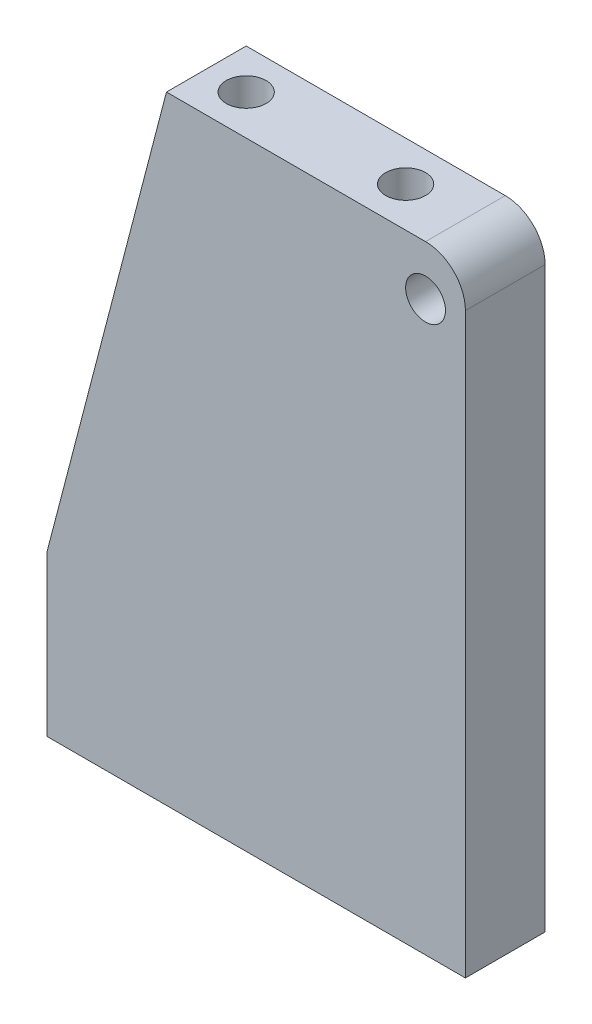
ISO-10303-21;
HEADER;
FILE_DESCRIPTION(('STEP AP214'),'2;1');
FILE_NAME('part.step','',(''),(''),'','','');
FILE_SCHEMA(('AUTOMOTIVE_DESIGN { 1 0 10303 214 1 1 1 1 }'));
ENDSEC;
DATA;
#1=APPLICATION_CONTEXT('core data for automotive mechanical design processes');
#2=APPLICATION_PROTOCOL_DEFINITION('international standard','automotive_design',2000,#1);
#3=PRODUCT_CONTEXT('',#1,'mechanical');
#4=PRODUCT('Part','Part','',(#3));
#5=PRODUCT_RELATED_PRODUCT_CATEGORY('part','',(#4));
#6=PRODUCT_DEFINITION_FORMATION('','',#4);
#7=PRODUCT_DEFINITION_CONTEXT('part definition',#1,'design');
#8=PRODUCT_DEFINITION('design','',#6,#7);
#9=PRODUCT_DEFINITION_SHAPE('','',#8);
#10=(LENGTH_UNIT() NAMED_UNIT(*) SI_UNIT(.MILLI.,.METRE.));
#11=(NAMED_UNIT(*) PLANE_ANGLE_UNIT() SI_UNIT($,.RADIAN.));
#12=(NAMED_UNIT(*) SI_UNIT($,.STERADIAN.) SOLID_ANGLE_UNIT());
#13=UNCERTAINTY_MEASURE_WITH_UNIT(LENGTH_MEASURE(1.E-05),#10,'distance_accuracy_value','');
#14=(GEOMETRIC_REPRESENTATION_CONTEXT(3) GLOBAL_UNCERTAINTY_ASSIGNED_CONTEXT((#13)) GLOBAL_UNIT_ASSIGNED_CONTEXT((#10,
#11,#12)) REPRESENTATION_CONTEXT('',''));
#15=CARTESIAN_POINT('',(0.,0.,0.));
#16=DIRECTION('',(0.,0.,1.));
#17=DIRECTION('',(1.,0.,0.));
#18=AXIS2_PLACEMENT_3D('',#15,#16,#17);
#19=CARTESIAN_POINT('',(0.,0.,6.35));
#20=DIRECTION('',(0.,0.,1.));
#21=DIRECTION('',(1.,0.,0.));
#22=AXIS2_PLACEMENT_3D('',#19,#20,#21);
#23=PLANE('',#22);
#24=DIRECTION('',(0.,1.,0.));
#25=VECTOR('',#24,1.);
#26=CARTESIAN_POINT('',(33.3375,0.,6.35));
#27=LINE('',#26,#25);
#28=CARTESIAN_POINT('',(33.3375,0.,6.35));
#29=VERTEX_POINT('',#28);
#30=CARTESIAN_POINT('',(33.3375,92.075,6.35));
#31=VERTEX_POINT('',#30);
#32=EDGE_CURVE('E138',#29,#31,#27,.T.);
#33=ORIENTED_EDGE('',*,*,#32,.T.);
#34=CARTESIAN_POINT('',(26.9875,92.075,6.35));
#35=DIRECTION('',(0.,0.,1.));
#36=DIRECTION('',(1.,0.,0.));
#37=AXIS2_PLACEMENT_3D('',#34,#35,#36);
#38=CIRCLE('',#37,6.35);
#39=CARTESIAN_POINT('',(26.9875,98.425,6.35));
#40=VERTEX_POINT('',#39);
#41=EDGE_CURVE('E11',#31,#40,#38,.T.);
#42=ORIENTED_EDGE('',*,*,#41,.T.);
#43=DIRECTION('',(-1.,0.,0.));
#44=VECTOR('',#43,1.);
#45=CARTESIAN_POINT('',(33.3375,98.425,6.35));
#46=LINE('',#45,#44);
#47=CARTESIAN_POINT('',(-14.2875,98.425,6.35));
#48=VERTEX_POINT('',#47);
#49=EDGE_CURVE('E141',#40,#48,#46,.T.);
#50=ORIENTED_EDGE('',*,*,#49,.T.);
#51=DIRECTION('',(-0.252421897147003,-0.967617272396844,0.));
#52=VECTOR('',#51,1.);
#53=CARTESIAN_POINT('',(-14.2875,98.425,6.35));
#54=LINE('',#53,#52);
#55=CARTESIAN_POINT('',(-33.3375,25.4,6.35));
#56=VERTEX_POINT('',#55);
#57=EDGE_CURVE('E143',#48,#56,#54,.T.);
#58=ORIENTED_EDGE('',*,*,#57,.T.);
#59=DIRECTION('',(0.,-1.,0.));
#60=VECTOR('',#59,1.);
#61=CARTESIAN_POINT('',(-33.3375,25.4,6.35));
#62=LINE('',#61,#60);
#63=CARTESIAN_POINT('',(-33.3375,0.,6.35));
#64=VERTEX_POINT('',#63);
#65=EDGE_CURVE('E145',#56,#64,#62,.T.);
#66=ORIENTED_EDGE('',*,*,#65,.T.);
#67=DIRECTION('',(1.,0.,0.));
#68=VECTOR('',#67,1.);
#69=CARTESIAN_POINT('',(-33.3375,0.,6.35));
#70=LINE('',#69,#68);
#71=EDGE_CURVE('E136',#64,#29,#70,.T.);
#72=ORIENTED_EDGE('',*,*,#71,.T.);
#73=EDGE_LOOP('',(#33,#42,#50,#58,#66,#72));
#74=FACE_BOUND('',#73,.T.);
#75=CARTESIAN_POINT('',(26.9875,90.5002,6.35));
#76=DIRECTION('',(0.,0.,1.));
#77=DIRECTION('',(1.,0.,0.));
#78=AXIS2_PLACEMENT_3D('',#75,#76,#77);
#79=CIRCLE('',#78,3.175);
#80=CARTESIAN_POINT('',(30.1625,90.5002,6.35));
#81=VERTEX_POINT('',#80);
#82=EDGE_CURVE('E130',#81,#81,#79,.T.);
#83=ORIENTED_EDGE('',*,*,#82,.F.);
#84=EDGE_LOOP('',(#83));
#85=FACE_BOUND('',#84,.T.);
#86=ADVANCED_FACE('F33',(#74,#85),#23,.T.);
#87=CARTESIAN_POINT('',(0.,0.,-6.35));
#88=DIRECTION('',(0.,0.,1.));
#89=DIRECTION('',(1.,0.,0.));
#90=AXIS2_PLACEMENT_3D('',#87,#88,#89);
#91=PLANE('',#90);
#92=DIRECTION('',(-1.,0.,0.));
#93=VECTOR('',#92,1.);
#94=CARTESIAN_POINT('',(33.3375,98.425,-6.35));
#95=LINE('',#94,#93);
#96=CARTESIAN_POINT('',(26.9875,98.425,-6.35));
#97=VERTEX_POINT('',#96);
#98=CARTESIAN_POINT('',(-14.2875,98.425,-6.35));
#99=VERTEX_POINT('',#98);
#100=EDGE_CURVE('E151',#97,#99,#95,.T.);
#101=ORIENTED_EDGE('',*,*,#100,.F.);
#102=CARTESIAN_POINT('',(26.9875,92.075,-6.35));
#103=DIRECTION('',(0.,0.,1.));
#104=DIRECTION('',(1.,0.,0.));
#105=AXIS2_PLACEMENT_3D('',#102,#103,#104);
#106=CIRCLE('',#105,6.35);
#107=CARTESIAN_POINT('',(33.3375,92.075,-6.35));
#108=VERTEX_POINT('',#107);
#109=EDGE_CURVE('E55',#97,#108,#106,.F.);
#110=ORIENTED_EDGE('',*,*,#109,.T.);
#111=DIRECTION('',(0.,1.,0.));
#112=VECTOR('',#111,1.);
#113=CARTESIAN_POINT('',(33.3375,0.,-6.35));
#114=LINE('',#113,#112);
#115=CARTESIAN_POINT('',(33.3375,0.,-6.35));
#116=VERTEX_POINT('',#115);
#117=EDGE_CURVE('E149',#116,#108,#114,.T.);
#118=ORIENTED_EDGE('',*,*,#117,.F.);
#119=DIRECTION('',(1.,0.,0.));
#120=VECTOR('',#119,1.);
#121=CARTESIAN_POINT('',(0.,0.,-6.35));
#122=LINE('',#121,#120);
#123=CARTESIAN_POINT('',(-33.3375,0.,-6.35));
#124=VERTEX_POINT('',#123);
#125=EDGE_CURVE('E133',#124,#116,#122,.T.);
#126=ORIENTED_EDGE('',*,*,#125,.F.);
#127=DIRECTION('',(0.,-1.,0.));
#128=VECTOR('',#127,1.);
#129=CARTESIAN_POINT('',(-33.3375,25.4,-6.35));
#130=LINE('',#129,#128);
#131=CARTESIAN_POINT('',(-33.3375,25.4,-6.35));
#132=VERTEX_POINT('',#131);
#133=EDGE_CURVE('E139',#132,#124,#130,.T.);
#134=ORIENTED_EDGE('',*,*,#133,.F.);
#135=DIRECTION('',(-0.252421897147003,-0.967617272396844,0.));
#136=VECTOR('',#135,1.);
#137=CARTESIAN_POINT('',(-14.2875,98.425,-6.35));
#138=LINE('',#137,#136);
#139=EDGE_CURVE('E153',#99,#132,#138,.T.);
#140=ORIENTED_EDGE('',*,*,#139,.F.);
#141=EDGE_LOOP('',(#101,#110,#118,#126,#134,#140));
#142=FACE_BOUND('',#141,.T.);
#143=CARTESIAN_POINT('',(26.9875,90.5002,-6.35));
#144=DIRECTION('',(0.,0.,1.));
#145=DIRECTION('',(1.,0.,0.));
#146=AXIS2_PLACEMENT_3D('',#143,#144,#145);
#147=CIRCLE('',#146,3.175);
#148=CARTESIAN_POINT('',(30.1625,90.5002,-6.35));
#149=VERTEX_POINT('',#148);
#150=EDGE_CURVE('E129',#149,#149,#147,.T.);
#151=ORIENTED_EDGE('',*,*,#150,.T.);
#152=EDGE_LOOP('',(#151));
#153=FACE_BOUND('',#152,.T.);
#154=ADVANCED_FACE('F179',(#142,#153),#91,.F.);
#155=CARTESIAN_POINT('',(0.,0.,6.35));
#156=DIRECTION('',(0.,1.,0.));
#157=DIRECTION('',(0.,0.,1.));
#158=AXIS2_PLACEMENT_3D('',#155,#156,#157);
#159=PLANE('',#158);
#160=CARTESIAN_POINT('',(-25.4,0.,0.));
#161=DIRECTION('',(0.,-1.,0.));
#162=DIRECTION('',(0.,0.,-1.));
#163=AXIS2_PLACEMENT_3D('',#160,#161,#162);
#164=CIRCLE('',#163,3.96875);
#165=CARTESIAN_POINT('',(-25.4,0.,-3.96875));
#166=VERTEX_POINT('',#165);
#167=EDGE_CURVE('E117',#166,#166,#164,.T.);
#168=ORIENTED_EDGE('',*,*,#167,.F.);
#169=EDGE_LOOP('',(#168));
#170=FACE_BOUND('',#169,.T.);
#171=CARTESIAN_POINT('',(25.4,0.,0.));
#172=DIRECTION('',(0.,-1.,0.));
#173=DIRECTION('',(0.,0.,-1.));
#174=AXIS2_PLACEMENT_3D('',#171,#172,#173);
#175=CIRCLE('',#174,3.96875);
#176=CARTESIAN_POINT('',(25.4,0.,-3.96875));
#177=VERTEX_POINT('',#176);
#178=EDGE_CURVE('E123',#177,#177,#175,.T.);
#179=ORIENTED_EDGE('',*,*,#178,.F.);
#180=EDGE_LOOP('',(#179));
#181=FACE_BOUND('',#180,.T.);
#182=ORIENTED_EDGE('',*,*,#125,.T.);
#183=DIRECTION('',(0.,0.,-1.));
#184=VECTOR('',#183,1.);
#185=CARTESIAN_POINT('',(33.3375,0.,6.35));
#186=LINE('',#185,#184);
#187=EDGE_CURVE('E165',#29,#116,#186,.T.);
#188=ORIENTED_EDGE('',*,*,#187,.F.);
#189=ORIENTED_EDGE('',*,*,#71,.F.);
#190=DIRECTION('',(0.,0.,-1.));
#191=VECTOR('',#190,1.);
#192=CARTESIAN_POINT('',(-33.3375,0.,6.35));
#193=LINE('',#192,#191);
#194=EDGE_CURVE('E147',#64,#124,#193,.T.);
#195=ORIENTED_EDGE('',*,*,#194,.T.);
#196=EDGE_LOOP('',(#182,#188,#189,#195));
#197=FACE_BOUND('',#196,.T.);
#198=ADVANCED_FACE('F204',(#170,#181,#197),#159,.F.);
#199=CARTESIAN_POINT('',(33.3375,0.,6.35));
#200=DIRECTION('',(-1.,0.,0.));
#201=DIRECTION('',(0.,0.,1.));
#202=AXIS2_PLACEMENT_3D('',#199,#200,#201);
#203=PLANE('',#202);
#204=ORIENTED_EDGE('',*,*,#117,.T.);
#205=DIRECTION('',(0.,0.,-1.));
#206=VECTOR('',#205,1.);
#207=CARTESIAN_POINT('',(33.3375,92.075,6.35));
#208=LINE('',#207,#206);
#209=EDGE_CURVE('E41',#108,#31,#208,.F.);
#210=ORIENTED_EDGE('',*,*,#209,.T.);
#211=ORIENTED_EDGE('',*,*,#32,.F.);
#212=ORIENTED_EDGE('',*,*,#187,.T.);
#213=EDGE_LOOP('',(#204,#210,#211,#212));
#214=FACE_BOUND('',#213,.T.);
#215=ADVANCED_FACE('F216',(#214),#203,.F.);
#216=CARTESIAN_POINT('',(33.3375,98.425,6.35));
#217=DIRECTION('',(0.,-1.,0.));
#218=DIRECTION('',(1.,0.,0.));
#219=AXIS2_PLACEMENT_3D('',#216,#217,#218);
#220=PLANE('',#219);
#221=CARTESIAN_POINT('',(-7.93750000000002,98.425,0.));
#222=DIRECTION('',(0.,1.,0.));
#223=DIRECTION('',(0.,0.,1.));
#224=AXIS2_PLACEMENT_3D('',#221,#222,#223);
#225=CIRCLE('',#224,3.175);
#226=CARTESIAN_POINT('',(-7.93750000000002,98.425,3.175));
#227=VERTEX_POINT('',#226);
#228=EDGE_CURVE('E107',#227,#227,#225,.T.);
#229=ORIENTED_EDGE('',*,*,#228,.F.);
#230=EDGE_LOOP('',(#229));
#231=FACE_BOUND('',#230,.T.);
#232=CARTESIAN_POINT('',(17.4625,98.425,0.));
#233=DIRECTION('',(0.,1.,0.));
#234=DIRECTION('',(0.,0.,1.));
#235=AXIS2_PLACEMENT_3D('',#232,#233,#234);
#236=CIRCLE('',#235,3.175);
#237=CARTESIAN_POINT('',(17.4625,98.425,3.175));
#238=VERTEX_POINT('',#237);
#239=EDGE_CURVE('E106',#238,#238,#236,.T.);
#240=ORIENTED_EDGE('',*,*,#239,.F.);
#241=EDGE_LOOP('',(#240));
#242=FACE_BOUND('',#241,.T.);
#243=ORIENTED_EDGE('',*,*,#49,.F.);
#244=DIRECTION('',(0.,0.,-1.));
#245=VECTOR('',#244,1.);
#246=CARTESIAN_POINT('',(26.9875,98.425,6.35));
#247=LINE('',#246,#245);
#248=EDGE_CURVE('E168',#40,#97,#247,.T.);
#249=ORIENTED_EDGE('',*,*,#248,.T.);
#250=ORIENTED_EDGE('',*,*,#100,.T.);
#251=DIRECTION('',(0.,0.,-1.));
#252=VECTOR('',#251,1.);
#253=CARTESIAN_POINT('',(-14.2875,98.425,6.35));
#254=LINE('',#253,#252);
#255=EDGE_CURVE('E162',#48,#99,#254,.T.);
#256=ORIENTED_EDGE('',*,*,#255,.F.);
#257=EDGE_LOOP('',(#243,#249,#250,#256));
#258=FACE_BOUND('',#257,.T.);
#259=ADVANCED_FACE('F174',(#231,#242,#258),#220,.F.);
#260=CARTESIAN_POINT('',(-14.2875,98.425,6.35));
#261=DIRECTION('',(0.967617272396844,-0.252421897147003,0.));
#262=DIRECTION('',(0.252421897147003,0.967617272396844,0.));
#263=AXIS2_PLACEMENT_3D('',#260,#261,#262);
#264=PLANE('',#263);
#265=ORIENTED_EDGE('',*,*,#139,.T.);
#266=DIRECTION('',(0.,0.,-1.));
#267=VECTOR('',#266,1.);
#268=CARTESIAN_POINT('',(-33.3375,25.4,6.35));
#269=LINE('',#268,#267);
#270=EDGE_CURVE('E159',#56,#132,#269,.T.);
#271=ORIENTED_EDGE('',*,*,#270,.F.);
#272=ORIENTED_EDGE('',*,*,#57,.F.);
#273=ORIENTED_EDGE('',*,*,#255,.T.);
#274=EDGE_LOOP('',(#265,#271,#272,#273));
#275=FACE_BOUND('',#274,.T.);
#276=ADVANCED_FACE('F184',(#275),#264,.F.);
#277=CARTESIAN_POINT('',(-33.3375,25.4,6.35));
#278=DIRECTION('',(1.,0.,0.));
#279=DIRECTION('',(0.,1.,0.));
#280=AXIS2_PLACEMENT_3D('',#277,#278,#279);
#281=PLANE('',#280);
#282=ORIENTED_EDGE('',*,*,#133,.T.);
#283=ORIENTED_EDGE('',*,*,#194,.F.);
#284=ORIENTED_EDGE('',*,*,#65,.F.);
#285=ORIENTED_EDGE('',*,*,#270,.T.);
#286=EDGE_LOOP('',(#282,#283,#284,#285));
#287=FACE_BOUND('',#286,.T.);
#288=ADVANCED_FACE('F188',(#287),#281,.F.);
#289=CARTESIAN_POINT('',(26.9875,90.5002,6.35));
#290=DIRECTION('',(0.,0.,-1.));
#291=DIRECTION('',(-1.,0.,0.));
#292=AXIS2_PLACEMENT_3D('',#289,#290,#291);
#293=CYLINDRICAL_SURFACE('',#292,3.175);
#294=ORIENTED_EDGE('',*,*,#82,.T.);
#295=EDGE_LOOP('',(#294));
#296=FACE_BOUND('',#295,.T.);
#297=ORIENTED_EDGE('',*,*,#150,.F.);
#298=EDGE_LOOP('',(#297));
#299=FACE_BOUND('',#298,.T.);
#300=ADVANCED_FACE('F207',(#296,#299),#293,.F.);
#301=CARTESIAN_POINT('',(25.4,19.05,0.));
#302=DIRECTION('',(0.,-1.,0.));
#303=DIRECTION('',(0.,0.,-1.));
#304=AXIS2_PLACEMENT_3D('',#301,#302,#303);
#305=CONICAL_SURFACE('',#304,3.96875,1.02974425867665);
#306=CARTESIAN_POINT('',(25.4,21.4346655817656,0.));
#307=VERTEX_POINT('',#306);
#308=VERTEX_LOOP('',#307);
#309=FACE_BOUND('',#308,.T.);
#310=CARTESIAN_POINT('',(25.4,19.05,0.));
#311=DIRECTION('',(0.,-1.,0.));
#312=DIRECTION('',(0.,0.,-1.));
#313=AXIS2_PLACEMENT_3D('',#310,#311,#312);
#314=CIRCLE('',#313,3.96875);
#315=CARTESIAN_POINT('',(25.4,19.05,-3.96875));
#316=VERTEX_POINT('',#315);
#317=EDGE_CURVE('E126',#316,#316,#314,.T.);
#318=ORIENTED_EDGE('',*,*,#317,.T.);
#319=EDGE_LOOP('',(#318));
#320=FACE_BOUND('',#319,.T.);
#321=ADVANCED_FACE('F231',(#309,#320),#305,.F.);
#322=CARTESIAN_POINT('',(25.4,0.,0.));
#323=DIRECTION('',(0.,-1.,0.));
#324=DIRECTION('',(0.,0.,-1.));
#325=AXIS2_PLACEMENT_3D('',#322,#323,#324);
#326=CYLINDRICAL_SURFACE('',#325,3.96875);
#327=ORIENTED_EDGE('',*,*,#317,.F.);
#328=EDGE_LOOP('',(#327));
#329=FACE_BOUND('',#328,.T.);
#330=ORIENTED_EDGE('',*,*,#178,.T.);
#331=EDGE_LOOP('',(#330));
#332=FACE_BOUND('',#331,.T.);
#333=ADVANCED_FACE('F228',(#329,#332),#326,.F.);
#334=CARTESIAN_POINT('',(-25.4,19.05,0.));
#335=DIRECTION('',(0.,-1.,0.));
#336=DIRECTION('',(0.,0.,-1.));
#337=AXIS2_PLACEMENT_3D('',#334,#335,#336);
#338=CONICAL_SURFACE('',#337,3.96875,1.02974425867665);
#339=CARTESIAN_POINT('',(-25.4,21.4346655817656,0.));
#340=VERTEX_POINT('',#339);
#341=VERTEX_LOOP('',#340);
#342=FACE_BOUND('',#341,.T.);
#343=CARTESIAN_POINT('',(-25.4,19.05,0.));
#344=DIRECTION('',(0.,-1.,0.));
#345=DIRECTION('',(0.,0.,-1.));
#346=AXIS2_PLACEMENT_3D('',#343,#344,#345);
#347=CIRCLE('',#346,3.96875);
#348=CARTESIAN_POINT('',(-25.4,19.05,-3.96875));
#349=VERTEX_POINT('',#348);
#350=EDGE_CURVE('E120',#349,#349,#347,.T.);
#351=ORIENTED_EDGE('',*,*,#350,.T.);
#352=EDGE_LOOP('',(#351));
#353=FACE_BOUND('',#352,.T.);
#354=ADVANCED_FACE('F230',(#342,#353),#338,.F.);
#355=CARTESIAN_POINT('',(-25.4,0.,0.));
#356=DIRECTION('',(0.,-1.,0.));
#357=DIRECTION('',(0.,0.,-1.));
#358=AXIS2_PLACEMENT_3D('',#355,#356,#357);
#359=CYLINDRICAL_SURFACE('',#358,3.96875);
#360=ORIENTED_EDGE('',*,*,#350,.F.);
#361=EDGE_LOOP('',(#360));
#362=FACE_BOUND('',#361,.T.);
#363=ORIENTED_EDGE('',*,*,#167,.T.);
#364=EDGE_LOOP('',(#363));
#365=FACE_BOUND('',#364,.T.);
#366=ADVANCED_FACE('F238',(#362,#365),#359,.F.);
#367=CARTESIAN_POINT('',(17.4625,79.375,0.));
#368=DIRECTION('',(0.,1.,0.));
#369=DIRECTION('',(0.,0.,1.));
#370=AXIS2_PLACEMENT_3D('',#367,#368,#369);
#371=CONICAL_SURFACE('',#370,3.17499999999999,1.02974425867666);
#372=CARTESIAN_POINT('',(17.4625,77.4672675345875,0.));
#373=VERTEX_POINT('',#372);
#374=VERTEX_LOOP('',#373);
#375=FACE_BOUND('',#374,.T.);
#376=CARTESIAN_POINT('',(17.4625,79.375,0.));
#377=DIRECTION('',(0.,1.,0.));
#378=DIRECTION('',(0.,0.,1.));
#379=AXIS2_PLACEMENT_3D('',#376,#377,#378);
#380=CIRCLE('',#379,3.17499999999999);
#381=CARTESIAN_POINT('',(17.4625,79.375,3.17499999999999));
#382=VERTEX_POINT('',#381);
#383=EDGE_CURVE('E110',#382,#382,#380,.T.);
#384=ORIENTED_EDGE('',*,*,#383,.T.);
#385=EDGE_LOOP('',(#384));
#386=FACE_BOUND('',#385,.T.);
#387=ADVANCED_FACE('F246',(#375,#386),#371,.F.);
#388=CARTESIAN_POINT('',(17.4625,98.425,0.));
#389=DIRECTION('',(0.,1.,0.));
#390=DIRECTION('',(0.,0.,1.));
#391=AXIS2_PLACEMENT_3D('',#388,#389,#390);
#392=CYLINDRICAL_SURFACE('',#391,3.175);
#393=ORIENTED_EDGE('',*,*,#383,.F.);
#394=EDGE_LOOP('',(#393));
#395=FACE_BOUND('',#394,.T.);
#396=ORIENTED_EDGE('',*,*,#239,.T.);
#397=EDGE_LOOP('',(#396));
#398=FACE_BOUND('',#397,.T.);
#399=ADVANCED_FACE('F100',(#395,#398),#392,.F.);
#400=CARTESIAN_POINT('',(-7.93750000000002,79.375,0.));
#401=DIRECTION('',(0.,1.,0.));
#402=DIRECTION('',(0.,0.,1.));
#403=AXIS2_PLACEMENT_3D('',#400,#401,#402);
#404=CONICAL_SURFACE('',#403,3.175,1.02974425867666);
#405=CARTESIAN_POINT('',(-7.93750000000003,77.4672675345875,0.));
#406=VERTEX_POINT('',#405);
#407=VERTEX_LOOP('',#406);
#408=FACE_BOUND('',#407,.T.);
#409=CARTESIAN_POINT('',(-7.93750000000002,79.375,0.));
#410=DIRECTION('',(0.,1.,0.));
#411=DIRECTION('',(0.,0.,1.));
#412=AXIS2_PLACEMENT_3D('',#409,#410,#411);
#413=CIRCLE('',#412,3.175);
#414=CARTESIAN_POINT('',(-7.93750000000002,79.375,3.175));
#415=VERTEX_POINT('',#414);
#416=EDGE_CURVE('E104',#415,#415,#413,.T.);
#417=ORIENTED_EDGE('',*,*,#416,.T.);
#418=EDGE_LOOP('',(#417));
#419=FACE_BOUND('',#418,.T.);
#420=ADVANCED_FACE('F96',(#408,#419),#404,.F.);
#421=CARTESIAN_POINT('',(-7.93750000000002,98.425,0.));
#422=DIRECTION('',(0.,1.,0.));
#423=DIRECTION('',(0.,0.,1.));
#424=AXIS2_PLACEMENT_3D('',#421,#422,#423);
#425=CYLINDRICAL_SURFACE('',#424,3.175);
#426=ORIENTED_EDGE('',*,*,#416,.F.);
#427=EDGE_LOOP('',(#426));
#428=FACE_BOUND('',#427,.T.);
#429=ORIENTED_EDGE('',*,*,#228,.T.);
#430=EDGE_LOOP('',(#429));
#431=FACE_BOUND('',#430,.T.);
#432=ADVANCED_FACE('F99',(#428,#431),#425,.F.);
#433=CARTESIAN_POINT('',(26.9875,92.075,6.35));
#434=DIRECTION('',(0.,0.,-1.));
#435=DIRECTION('',(-1.,0.,0.));
#436=AXIS2_PLACEMENT_3D('',#433,#434,#435);
#437=CYLINDRICAL_SURFACE('',#436,6.35);
#438=ORIENTED_EDGE('',*,*,#41,.F.);
#439=ORIENTED_EDGE('',*,*,#209,.F.);
#440=ORIENTED_EDGE('',*,*,#109,.F.);
#441=ORIENTED_EDGE('',*,*,#248,.F.);
#442=EDGE_LOOP('',(#438,#439,#440,#441));
#443=FACE_BOUND('',#442,.T.);
#444=ADVANCED_FACE('F35',(#443),#437,.T.);
#445=CLOSED_SHELL('',(#86,#154,#198,#215,#259,#276,#288,#300,#321,#333,#354,#366,#387,#399,#420,
#432,#444));
#446=MANIFOLD_SOLID_BREP('B2',#445);
#447=ADVANCED_BREP_SHAPE_REPRESENTATION('',(#18,#446),#14);
#448=SHAPE_DEFINITION_REPRESENTATION(#9,#447);
ENDSEC;
END-ISO-10303-21;
